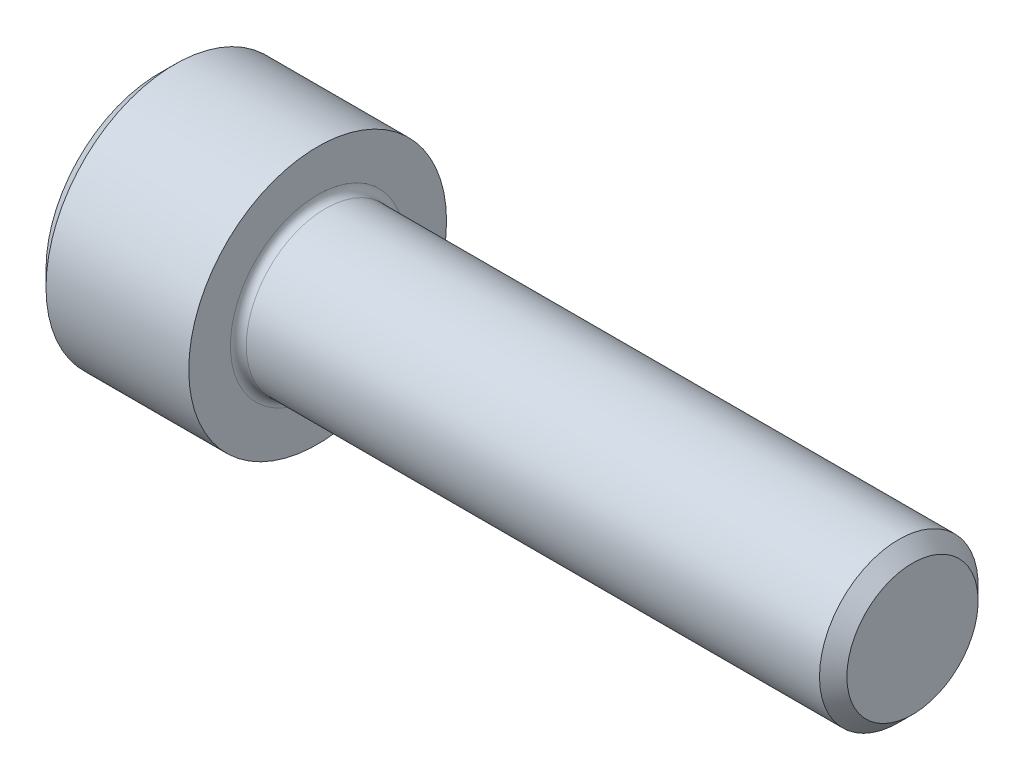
from build123d import *

# Parameters (mm, degrees)
FILLET1_R   = 0.4
HEX_2_DEPTH = 4


with BuildPart() as part:
    # BodySke → Base-Revolve (revolve)
    with BuildSketch(Plane.XY, mode=Mode.PRIVATE) as base_revolve_sk:
        Polygon((0, 0), (0, 5.7), (0.8, 6.5), (8, 6.5), (8, 4), (37.3095, 4), (38, 3.3095), (38, 0), align=None)
    revolve(base_revolve_sk.sketch.rotate(Axis((-31.75, 0, 0), (1, 0, 0)), 90), axis=Axis((-31.75, 0, 0), (1, 0, 0)))

    # Fillet1
    fillet1_edges = [part.edges().sort_by_distance(p)[0] for p in [
        (8, 0, -4),
    ]]
    fillet(fillet1_edges, radius=FILLET1_R)

    # Sketch2 → Hex-PreBroach (revolve, cut)
    with BuildSketch(Plane.XY, mode=Mode.PRIVATE) as hex_prebroach_sk:
        Polygon((0, 3.0475), (4, 3.0475), (5.759474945, 0), (0, 0), align=None)
    revolve(hex_prebroach_sk.sketch.rotate(Axis((0, 0, 0), (1, 0, 0)), 90), axis=Axis((0, 0, 0), (1, 0, 0)), mode=Mode.SUBTRACT)

    # Sketch3 → Hex 2 (cut)
    with BuildSketch(Plane(origin=(0, 0, 0), x_dir=(0, 0.500000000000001, 0.866025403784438), z_dir=(-1, 0, 0))):
        Polygon((1.759474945, 3.0475), (-1.759474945, 3.0475), (-3.518949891, 0), (-1.759474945, -3.0475), (1.759474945, -3.0475), (3.518949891, 0), align=None)
    extrude(amount=-HEX_2_DEPTH, mode=Mode.SUBTRACT)


solid = part.part
